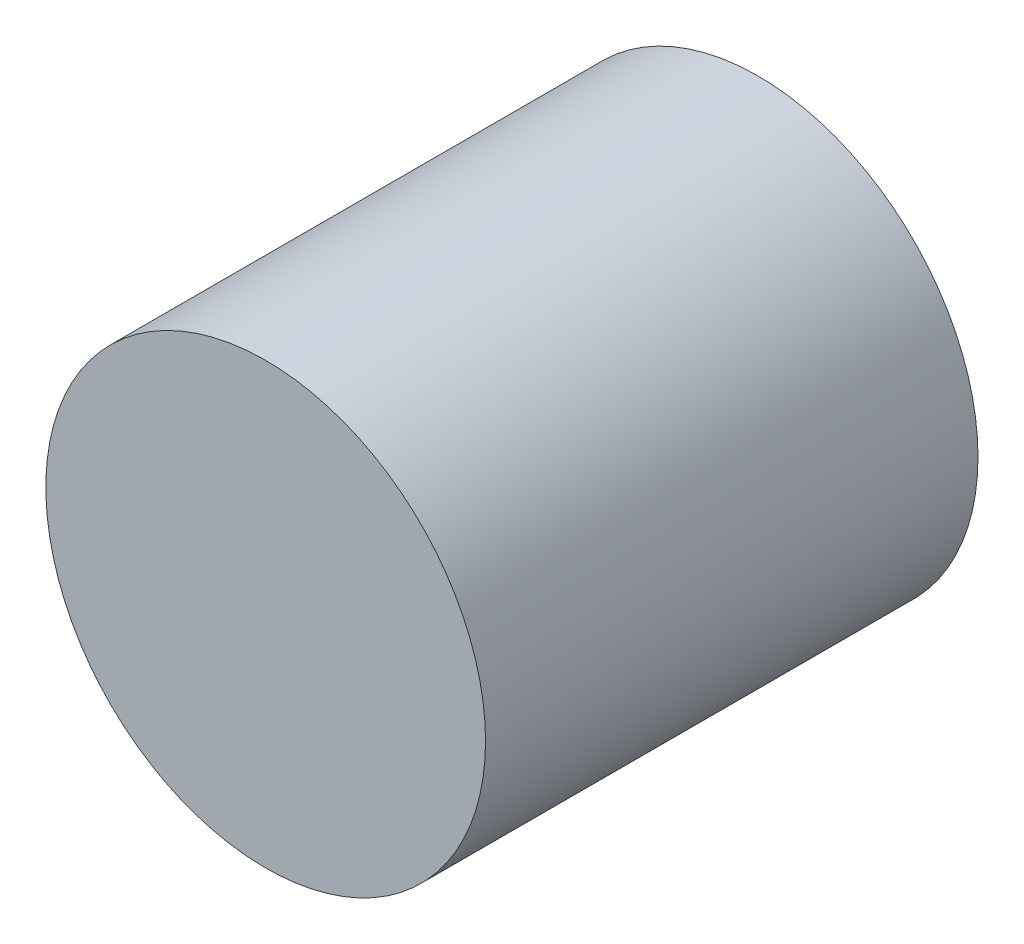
ISO-10303-21;
HEADER;
FILE_DESCRIPTION(('STEP AP214'),'2;1');
FILE_NAME('part.step','',(''),(''),'','','');
FILE_SCHEMA(('AUTOMOTIVE_DESIGN { 1 0 10303 214 1 1 1 1 }'));
ENDSEC;
DATA;
#1=APPLICATION_CONTEXT('core data for automotive mechanical design processes');
#2=APPLICATION_PROTOCOL_DEFINITION('international standard','automotive_design',2000,#1);
#3=PRODUCT_CONTEXT('',#1,'mechanical');
#4=PRODUCT('Part','Part','',(#3));
#5=PRODUCT_RELATED_PRODUCT_CATEGORY('part','',(#4));
#6=PRODUCT_DEFINITION_FORMATION('','',#4);
#7=PRODUCT_DEFINITION_CONTEXT('part definition',#1,'design');
#8=PRODUCT_DEFINITION('design','',#6,#7);
#9=PRODUCT_DEFINITION_SHAPE('','',#8);
#10=(LENGTH_UNIT() NAMED_UNIT(*) SI_UNIT(.MILLI.,.METRE.));
#11=(NAMED_UNIT(*) PLANE_ANGLE_UNIT() SI_UNIT($,.RADIAN.));
#12=(NAMED_UNIT(*) SI_UNIT($,.STERADIAN.) SOLID_ANGLE_UNIT());
#13=UNCERTAINTY_MEASURE_WITH_UNIT(LENGTH_MEASURE(1.E-05),#10,'distance_accuracy_value','');
#14=(GEOMETRIC_REPRESENTATION_CONTEXT(3) GLOBAL_UNCERTAINTY_ASSIGNED_CONTEXT((#13)) GLOBAL_UNIT_ASSIGNED_CONTEXT((#10,
#11,#12)) REPRESENTATION_CONTEXT('',''));
#15=CARTESIAN_POINT('',(0.,0.,0.));
#16=DIRECTION('',(0.,0.,1.));
#17=DIRECTION('',(1.,0.,0.));
#18=AXIS2_PLACEMENT_3D('',#15,#16,#17);
#19=CARTESIAN_POINT('',(0.,0.,56.));
#20=DIRECTION('',(0.,0.,-1.));
#21=DIRECTION('',(-1.,0.,0.));
#22=AXIS2_PLACEMENT_3D('',#19,#20,#21);
#23=CYLINDRICAL_SURFACE('',#22,25.);
#24=CARTESIAN_POINT('',(0.,0.,56.));
#25=DIRECTION('',(0.,0.,1.));
#26=DIRECTION('',(1.,0.,0.));
#27=AXIS2_PLACEMENT_3D('',#24,#25,#26);
#28=CIRCLE('',#27,25.);
#29=CARTESIAN_POINT('',(25.,0.,56.));
#30=VERTEX_POINT('',#29);
#31=EDGE_CURVE('E10',#30,#30,#28,.T.);
#32=ORIENTED_EDGE('',*,*,#31,.F.);
#33=EDGE_LOOP('',(#32));
#34=FACE_BOUND('',#33,.T.);
#35=CARTESIAN_POINT('',(0.,0.,0.));
#36=DIRECTION('',(0.,0.,1.));
#37=DIRECTION('',(1.,0.,0.));
#38=AXIS2_PLACEMENT_3D('',#35,#36,#37);
#39=CIRCLE('',#38,25.);
#40=CARTESIAN_POINT('',(25.,0.,0.));
#41=VERTEX_POINT('',#40);
#42=EDGE_CURVE('E32',#41,#41,#39,.T.);
#43=ORIENTED_EDGE('',*,*,#42,.T.);
#44=EDGE_LOOP('',(#43));
#45=FACE_BOUND('',#44,.T.);
#46=ADVANCED_FACE('F29',(#34,#45),#23,.T.);
#47=CARTESIAN_POINT('',(0.,0.,56.));
#48=DIRECTION('',(0.,0.,1.));
#49=DIRECTION('',(1.,0.,0.));
#50=AXIS2_PLACEMENT_3D('',#47,#48,#49);
#51=PLANE('',#50);
#52=ORIENTED_EDGE('',*,*,#31,.T.);
#53=EDGE_LOOP('',(#52));
#54=FACE_BOUND('',#53,.T.);
#55=ADVANCED_FACE('F44',(#54),#51,.T.);
#56=CARTESIAN_POINT('',(0.,0.,0.));
#57=DIRECTION('',(0.,0.,1.));
#58=DIRECTION('',(1.,0.,0.));
#59=AXIS2_PLACEMENT_3D('',#56,#57,#58);
#60=PLANE('',#59);
#61=ORIENTED_EDGE('',*,*,#42,.F.);
#62=EDGE_LOOP('',(#61));
#63=FACE_BOUND('',#62,.T.);
#64=ADVANCED_FACE('F42',(#63),#60,.F.);
#65=CLOSED_SHELL('',(#46,#55,#64));
#66=MANIFOLD_SOLID_BREP('B2',#65);
#67=ADVANCED_BREP_SHAPE_REPRESENTATION('',(#18,#66),#14);
#68=SHAPE_DEFINITION_REPRESENTATION(#9,#67);
ENDSEC;
END-ISO-10303-21;
